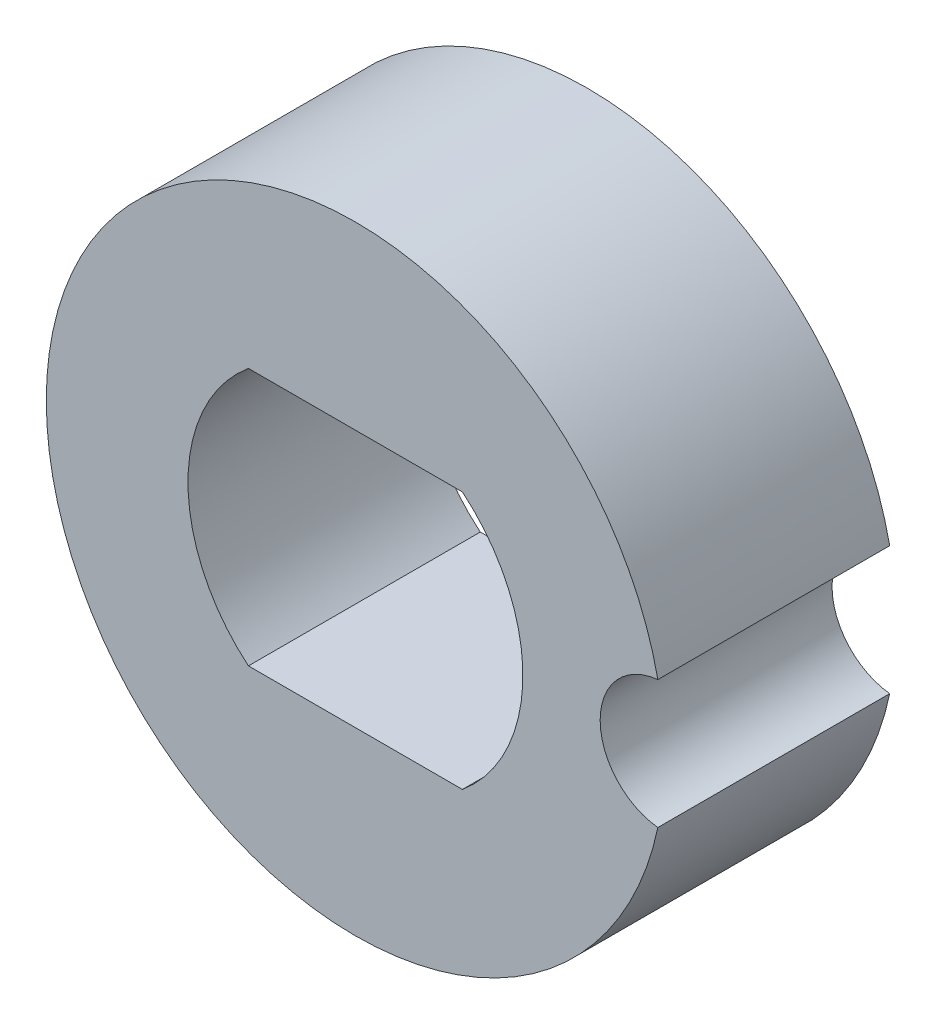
ISO-10303-21;
HEADER;
FILE_DESCRIPTION(('STEP AP214'),'2;1');
FILE_NAME('part.step','',(''),(''),'','','');
FILE_SCHEMA(('AUTOMOTIVE_DESIGN { 1 0 10303 214 1 1 1 1 }'));
ENDSEC;
DATA;
#1=APPLICATION_CONTEXT('core data for automotive mechanical design processes');
#2=APPLICATION_PROTOCOL_DEFINITION('international standard','automotive_design',2000,#1);
#3=PRODUCT_CONTEXT('',#1,'mechanical');
#4=PRODUCT('Part','Part','',(#3));
#5=PRODUCT_RELATED_PRODUCT_CATEGORY('part','',(#4));
#6=PRODUCT_DEFINITION_FORMATION('','',#4);
#7=PRODUCT_DEFINITION_CONTEXT('part definition',#1,'design');
#8=PRODUCT_DEFINITION('design','',#6,#7);
#9=PRODUCT_DEFINITION_SHAPE('','',#8);
#10=(LENGTH_UNIT() NAMED_UNIT(*) SI_UNIT(.MILLI.,.METRE.));
#11=(NAMED_UNIT(*) PLANE_ANGLE_UNIT() SI_UNIT($,.RADIAN.));
#12=(NAMED_UNIT(*) SI_UNIT($,.STERADIAN.) SOLID_ANGLE_UNIT());
#13=UNCERTAINTY_MEASURE_WITH_UNIT(LENGTH_MEASURE(1.E-05),#10,'distance_accuracy_value','');
#14=(GEOMETRIC_REPRESENTATION_CONTEXT(3) GLOBAL_UNCERTAINTY_ASSIGNED_CONTEXT((#13)) GLOBAL_UNIT_ASSIGNED_CONTEXT((#10,
#11,#12)) REPRESENTATION_CONTEXT('',''));
#15=CARTESIAN_POINT('',(0.,0.,0.));
#16=DIRECTION('',(0.,0.,1.));
#17=DIRECTION('',(1.,0.,0.));
#18=AXIS2_PLACEMENT_3D('',#15,#16,#17);
#19=CARTESIAN_POINT('',(6.,0.,9.));
#20=DIRECTION('',(0.,0.,1.));
#21=DIRECTION('',(1.,0.,0.));
#22=AXIS2_PLACEMENT_3D('',#19,#20,#21);
#23=PLANE('',#22);
#24=CARTESIAN_POINT('',(0.,0.,9.));
#25=DIRECTION('',(0.,0.,1.));
#26=DIRECTION('',(1.,0.,0.));
#27=AXIS2_PLACEMENT_3D('',#24,#25,#26);
#28=CIRCLE('',#27,12.);
#29=CARTESIAN_POINT('',(11.7395833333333,2.48639963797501,9.));
#30=VERTEX_POINT('',#29);
#31=CARTESIAN_POINT('',(11.7395833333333,-2.486399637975,9.));
#32=VERTEX_POINT('',#31);
#33=EDGE_CURVE('E105',#30,#32,#28,.T.);
#34=ORIENTED_EDGE('',*,*,#33,.T.);
#35=CARTESIAN_POINT('',(12.,0.,9.));
#36=DIRECTION('',(0.,0.,1.));
#37=DIRECTION('',(1.,0.,0.));
#38=AXIS2_PLACEMENT_3D('',#35,#36,#37);
#39=CIRCLE('',#38,2.5);
#40=EDGE_CURVE('E108',#30,#32,#39,.T.);
#41=ORIENTED_EDGE('',*,*,#40,.F.);
#42=EDGE_LOOP('',(#34,#41));
#43=FACE_BOUND('',#42,.T.);
#44=DIRECTION('',(-1.,0.,0.));
#45=VECTOR('',#44,1.);
#46=CARTESIAN_POINT('',(4.15331193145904,-5.,9.));
#47=LINE('',#46,#45);
#48=CARTESIAN_POINT('',(4.15331193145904,-5.,9.));
#49=VERTEX_POINT('',#48);
#50=CARTESIAN_POINT('',(-4.15331193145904,-5.,9.));
#51=VERTEX_POINT('',#50);
#52=EDGE_CURVE('E95',#49,#51,#47,.T.);
#53=ORIENTED_EDGE('',*,*,#52,.T.);
#54=CARTESIAN_POINT('',(0.,0.,9.));
#55=DIRECTION('',(0.,0.,1.));
#56=DIRECTION('',(1.,0.,0.));
#57=AXIS2_PLACEMENT_3D('',#54,#55,#56);
#58=CIRCLE('',#57,6.5);
#59=CARTESIAN_POINT('',(-4.15331193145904,5.,9.));
#60=VERTEX_POINT('',#59);
#61=EDGE_CURVE('E68',#60,#51,#58,.T.);
#62=ORIENTED_EDGE('',*,*,#61,.F.);
#63=DIRECTION('',(-1.,0.,0.));
#64=VECTOR('',#63,1.);
#65=CARTESIAN_POINT('',(4.15331193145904,5.,9.));
#66=LINE('',#65,#64);
#67=CARTESIAN_POINT('',(4.15331193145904,5.,9.));
#68=VERTEX_POINT('',#67);
#69=EDGE_CURVE('E90',#68,#60,#66,.T.);
#70=ORIENTED_EDGE('',*,*,#69,.F.);
#71=CARTESIAN_POINT('',(0.,0.,9.));
#72=DIRECTION('',(0.,0.,1.));
#73=DIRECTION('',(1.,0.,0.));
#74=AXIS2_PLACEMENT_3D('',#71,#72,#73);
#75=CIRCLE('',#74,6.5);
#76=EDGE_CURVE('E29',#49,#68,#75,.T.);
#77=ORIENTED_EDGE('',*,*,#76,.F.);
#78=EDGE_LOOP('',(#53,#62,#70,#77));
#79=FACE_BOUND('',#78,.T.);
#80=ADVANCED_FACE('F14',(#43,#79),#23,.T.);
#81=CARTESIAN_POINT('',(6.,0.,0.));
#82=DIRECTION('',(0.,0.,1.));
#83=DIRECTION('',(1.,0.,0.));
#84=AXIS2_PLACEMENT_3D('',#81,#82,#83);
#85=PLANE('',#84);
#86=CARTESIAN_POINT('',(0.,0.,0.));
#87=DIRECTION('',(0.,0.,1.));
#88=DIRECTION('',(1.,0.,0.));
#89=AXIS2_PLACEMENT_3D('',#86,#87,#88);
#90=CIRCLE('',#89,12.);
#91=CARTESIAN_POINT('',(11.7395833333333,2.48639963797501,0.));
#92=VERTEX_POINT('',#91);
#93=CARTESIAN_POINT('',(11.7395833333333,-2.486399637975,0.));
#94=VERTEX_POINT('',#93);
#95=EDGE_CURVE('E72',#92,#94,#90,.T.);
#96=ORIENTED_EDGE('',*,*,#95,.F.);
#97=CARTESIAN_POINT('',(12.,0.,0.));
#98=DIRECTION('',(0.,0.,1.));
#99=DIRECTION('',(1.,0.,0.));
#100=AXIS2_PLACEMENT_3D('',#97,#98,#99);
#101=CIRCLE('',#100,2.5);
#102=EDGE_CURVE('E102',#92,#94,#101,.T.);
#103=ORIENTED_EDGE('',*,*,#102,.T.);
#104=EDGE_LOOP('',(#96,#103));
#105=FACE_BOUND('',#104,.T.);
#106=CARTESIAN_POINT('',(0.,0.,0.));
#107=DIRECTION('',(0.,0.,1.));
#108=DIRECTION('',(1.,0.,0.));
#109=AXIS2_PLACEMENT_3D('',#106,#107,#108);
#110=CIRCLE('',#109,6.5);
#111=CARTESIAN_POINT('',(-4.15331193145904,5.,0.));
#112=VERTEX_POINT('',#111);
#113=CARTESIAN_POINT('',(-4.15331193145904,-5.,0.));
#114=VERTEX_POINT('',#113);
#115=EDGE_CURVE('E37',#112,#114,#110,.T.);
#116=ORIENTED_EDGE('',*,*,#115,.T.);
#117=DIRECTION('',(-1.,0.,0.));
#118=VECTOR('',#117,1.);
#119=CARTESIAN_POINT('',(4.15331193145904,-5.,0.));
#120=LINE('',#119,#118);
#121=CARTESIAN_POINT('',(4.15331193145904,-5.,0.));
#122=VERTEX_POINT('',#121);
#123=EDGE_CURVE('E76',#122,#114,#120,.T.);
#124=ORIENTED_EDGE('',*,*,#123,.F.);
#125=CARTESIAN_POINT('',(0.,0.,0.));
#126=DIRECTION('',(0.,0.,1.));
#127=DIRECTION('',(1.,0.,0.));
#128=AXIS2_PLACEMENT_3D('',#125,#126,#127);
#129=CIRCLE('',#128,6.5);
#130=CARTESIAN_POINT('',(4.15331193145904,5.,0.));
#131=VERTEX_POINT('',#130);
#132=EDGE_CURVE('E81',#122,#131,#129,.T.);
#133=ORIENTED_EDGE('',*,*,#132,.T.);
#134=DIRECTION('',(-1.,0.,0.));
#135=VECTOR('',#134,1.);
#136=CARTESIAN_POINT('',(4.15331193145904,5.,0.));
#137=LINE('',#136,#135);
#138=EDGE_CURVE('E86',#131,#112,#137,.T.);
#139=ORIENTED_EDGE('',*,*,#138,.T.);
#140=EDGE_LOOP('',(#116,#124,#133,#139));
#141=FACE_BOUND('',#140,.T.);
#142=ADVANCED_FACE('F84',(#105,#141),#85,.F.);
#143=CARTESIAN_POINT('',(0.,0.,9.));
#144=DIRECTION('',(0.,0.,-1.));
#145=DIRECTION('',(-1.,0.,0.));
#146=AXIS2_PLACEMENT_3D('',#143,#144,#145);
#147=CYLINDRICAL_SURFACE('',#146,12.);
#148=DIRECTION('',(0.,0.,-1.));
#149=VECTOR('',#148,1.);
#150=CARTESIAN_POINT('',(11.7395833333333,-2.486399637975,9.));
#151=LINE('',#150,#149);
#152=EDGE_CURVE('E9',#32,#94,#151,.T.);
#153=ORIENTED_EDGE('',*,*,#152,.F.);
#154=ORIENTED_EDGE('',*,*,#33,.F.);
#155=DIRECTION('',(0.,0.,-1.));
#156=VECTOR('',#155,1.);
#157=CARTESIAN_POINT('',(11.7395833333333,2.48639963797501,9.));
#158=LINE('',#157,#156);
#159=EDGE_CURVE('E22',#30,#92,#158,.T.);
#160=ORIENTED_EDGE('',*,*,#159,.T.);
#161=ORIENTED_EDGE('',*,*,#95,.T.);
#162=EDGE_LOOP('',(#153,#154,#160,#161));
#163=FACE_BOUND('',#162,.T.);
#164=ADVANCED_FACE('F115',(#163),#147,.T.);
#165=CARTESIAN_POINT('',(12.,0.,9.));
#166=DIRECTION('',(0.,0.,-1.));
#167=DIRECTION('',(-1.,0.,0.));
#168=AXIS2_PLACEMENT_3D('',#165,#166,#167);
#169=CYLINDRICAL_SURFACE('',#168,2.5);
#170=ORIENTED_EDGE('',*,*,#40,.T.);
#171=ORIENTED_EDGE('',*,*,#152,.T.);
#172=ORIENTED_EDGE('',*,*,#102,.F.);
#173=ORIENTED_EDGE('',*,*,#159,.F.);
#174=EDGE_LOOP('',(#170,#171,#172,#173));
#175=FACE_BOUND('',#174,.T.);
#176=ADVANCED_FACE('F16',(#175),#169,.F.);
#177=CARTESIAN_POINT('',(0.,0.,9.));
#178=DIRECTION('',(0.,0.,-1.));
#179=DIRECTION('',(-1.,0.,0.));
#180=AXIS2_PLACEMENT_3D('',#177,#178,#179);
#181=CYLINDRICAL_SURFACE('',#180,6.5);
#182=DIRECTION('',(0.,0.,-1.));
#183=VECTOR('',#182,1.);
#184=CARTESIAN_POINT('',(-4.15331193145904,-5.,9.));
#185=LINE('',#184,#183);
#186=EDGE_CURVE('E64',#51,#114,#185,.T.);
#187=ORIENTED_EDGE('',*,*,#186,.T.);
#188=ORIENTED_EDGE('',*,*,#115,.F.);
#189=DIRECTION('',(0.,0.,-1.));
#190=VECTOR('',#189,1.);
#191=CARTESIAN_POINT('',(-4.15331193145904,5.,9.));
#192=LINE('',#191,#190);
#193=EDGE_CURVE('E93',#60,#112,#192,.T.);
#194=ORIENTED_EDGE('',*,*,#193,.F.);
#195=ORIENTED_EDGE('',*,*,#61,.T.);
#196=EDGE_LOOP('',(#187,#188,#194,#195));
#197=FACE_BOUND('',#196,.T.);
#198=ADVANCED_FACE('F66',(#197),#181,.F.);
#199=CARTESIAN_POINT('',(4.15331193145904,-5.,9.));
#200=DIRECTION('',(0.,-1.,0.));
#201=DIRECTION('',(1.,0.,0.));
#202=AXIS2_PLACEMENT_3D('',#199,#200,#201);
#203=PLANE('',#202);
#204=DIRECTION('',(0.,0.,-1.));
#205=VECTOR('',#204,1.);
#206=CARTESIAN_POINT('',(4.15331193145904,-5.,9.));
#207=LINE('',#206,#205);
#208=EDGE_CURVE('E73',#49,#122,#207,.T.);
#209=ORIENTED_EDGE('',*,*,#208,.T.);
#210=ORIENTED_EDGE('',*,*,#123,.T.);
#211=ORIENTED_EDGE('',*,*,#186,.F.);
#212=ORIENTED_EDGE('',*,*,#52,.F.);
#213=EDGE_LOOP('',(#209,#210,#211,#212));
#214=FACE_BOUND('',#213,.T.);
#215=ADVANCED_FACE('F77',(#214),#203,.F.);
#216=CARTESIAN_POINT('',(0.,0.,9.));
#217=DIRECTION('',(0.,0.,-1.));
#218=DIRECTION('',(-1.,0.,0.));
#219=AXIS2_PLACEMENT_3D('',#216,#217,#218);
#220=CYLINDRICAL_SURFACE('',#219,6.5);
#221=DIRECTION('',(0.,0.,-1.));
#222=VECTOR('',#221,1.);
#223=CARTESIAN_POINT('',(4.15331193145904,5.,9.));
#224=LINE('',#223,#222);
#225=EDGE_CURVE('E99',#68,#131,#224,.T.);
#226=ORIENTED_EDGE('',*,*,#225,.T.);
#227=ORIENTED_EDGE('',*,*,#132,.F.);
#228=ORIENTED_EDGE('',*,*,#208,.F.);
#229=ORIENTED_EDGE('',*,*,#76,.T.);
#230=EDGE_LOOP('',(#226,#227,#228,#229));
#231=FACE_BOUND('',#230,.T.);
#232=ADVANCED_FACE('F127',(#231),#220,.F.);
#233=CARTESIAN_POINT('',(4.15331193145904,5.,9.));
#234=DIRECTION('',(0.,-1.,0.));
#235=DIRECTION('',(1.,0.,0.));
#236=AXIS2_PLACEMENT_3D('',#233,#234,#235);
#237=PLANE('',#236);
#238=ORIENTED_EDGE('',*,*,#69,.T.);
#239=ORIENTED_EDGE('',*,*,#193,.T.);
#240=ORIENTED_EDGE('',*,*,#138,.F.);
#241=ORIENTED_EDGE('',*,*,#225,.F.);
#242=EDGE_LOOP('',(#238,#239,#240,#241));
#243=FACE_BOUND('',#242,.T.);
#244=ADVANCED_FACE('F126',(#243),#237,.T.);
#245=CLOSED_SHELL('',(#80,#142,#164,#176,#198,#215,#232,#244));
#246=MANIFOLD_SOLID_BREP('B1',#245);
#247=ADVANCED_BREP_SHAPE_REPRESENTATION('',(#18,#246),#14);
#248=SHAPE_DEFINITION_REPRESENTATION(#9,#247);
ENDSEC;
END-ISO-10303-21;
